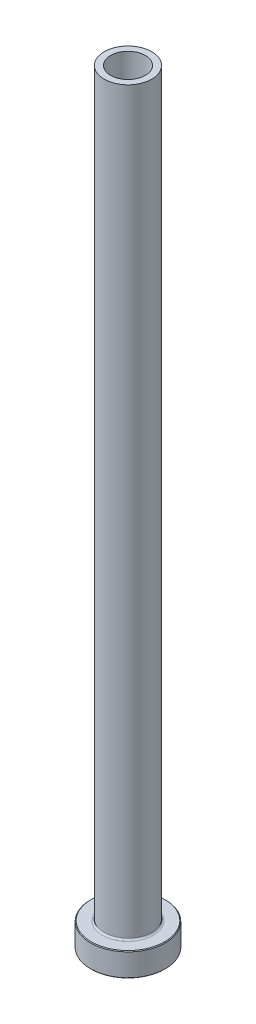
ISO-10303-21;
HEADER;
FILE_DESCRIPTION(('STEP AP214'),'2;1');
FILE_NAME('part.step','',(''),(''),'','','');
FILE_SCHEMA(('AUTOMOTIVE_DESIGN { 1 0 10303 214 1 1 1 1 }'));
ENDSEC;
DATA;
#1=APPLICATION_CONTEXT('core data for automotive mechanical design processes');
#2=APPLICATION_PROTOCOL_DEFINITION('international standard','automotive_design',2000,#1);
#3=PRODUCT_CONTEXT('',#1,'mechanical');
#4=PRODUCT('Part','Part','',(#3));
#5=PRODUCT_RELATED_PRODUCT_CATEGORY('part','',(#4));
#6=PRODUCT_DEFINITION_FORMATION('','',#4);
#7=PRODUCT_DEFINITION_CONTEXT('part definition',#1,'design');
#8=PRODUCT_DEFINITION('design','',#6,#7);
#9=PRODUCT_DEFINITION_SHAPE('','',#8);
#10=(LENGTH_UNIT() NAMED_UNIT(*) SI_UNIT(.MILLI.,.METRE.));
#11=(NAMED_UNIT(*) PLANE_ANGLE_UNIT() SI_UNIT($,.RADIAN.));
#12=(NAMED_UNIT(*) SI_UNIT($,.STERADIAN.) SOLID_ANGLE_UNIT());
#13=UNCERTAINTY_MEASURE_WITH_UNIT(LENGTH_MEASURE(1.E-05),#10,'distance_accuracy_value','');
#14=(GEOMETRIC_REPRESENTATION_CONTEXT(3) GLOBAL_UNCERTAINTY_ASSIGNED_CONTEXT((#13)) GLOBAL_UNIT_ASSIGNED_CONTEXT((#10,
#11,#12)) REPRESENTATION_CONTEXT('',''));
#15=CARTESIAN_POINT('',(0.,0.,0.));
#16=DIRECTION('',(0.,0.,1.));
#17=DIRECTION('',(1.,0.,0.));
#18=AXIS2_PLACEMENT_3D('',#15,#16,#17);
#19=CARTESIAN_POINT('',(0.,92.1876809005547,0.));
#20=DIRECTION('',(0.,1.,0.));
#21=DIRECTION('',(0.,0.,1.));
#22=AXIS2_PLACEMENT_3D('',#19,#20,#21);
#23=CYLINDRICAL_SURFACE('',#22,5.10000000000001);
#24=CARTESIAN_POINT('',(0.,225.,0.));
#25=DIRECTION('',(0.,1.,0.));
#26=DIRECTION('',(0.,0.,1.));
#27=AXIS2_PLACEMENT_3D('',#24,#25,#26);
#28=CIRCLE('',#27,5.10000000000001);
#29=CARTESIAN_POINT('',(0.,225.,5.10000000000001));
#30=VERTEX_POINT('',#29);
#31=EDGE_CURVE('E62',#30,#30,#28,.T.);
#32=ORIENTED_EDGE('',*,*,#31,.T.);
#33=EDGE_LOOP('',(#32));
#34=FACE_BOUND('',#33,.T.);
#35=CARTESIAN_POINT('',(0.,170.,0.));
#36=DIRECTION('',(0.,1.,0.));
#37=DIRECTION('',(0.,0.,1.));
#38=AXIS2_PLACEMENT_3D('',#35,#36,#37);
#39=CIRCLE('',#38,5.10000000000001);
#40=CARTESIAN_POINT('',(0.,170.,5.10000000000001));
#41=VERTEX_POINT('',#40);
#42=EDGE_CURVE('E71',#41,#41,#39,.T.);
#43=ORIENTED_EDGE('',*,*,#42,.F.);
#44=EDGE_LOOP('',(#43));
#45=FACE_BOUND('',#44,.T.);
#46=ADVANCED_FACE('F30',(#34,#45),#23,.F.);
#47=CARTESIAN_POINT('',(-5.10000000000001,225.,0.));
#48=DIRECTION('',(0.,1.,0.));
#49=DIRECTION('',(0.,0.,1.));
#50=AXIS2_PLACEMENT_3D('',#47,#48,#49);
#51=PLANE('',#50);
#52=CARTESIAN_POINT('',(0.,225.,0.));
#53=DIRECTION('',(0.,1.,0.));
#54=DIRECTION('',(0.,0.,1.));
#55=AXIS2_PLACEMENT_3D('',#52,#53,#54);
#56=CIRCLE('',#55,7.00000000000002);
#57=CARTESIAN_POINT('',(0.,225.,7.00000000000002));
#58=VERTEX_POINT('',#57);
#59=EDGE_CURVE('E65',#58,#58,#56,.T.);
#60=ORIENTED_EDGE('',*,*,#59,.T.);
#61=EDGE_LOOP('',(#60));
#62=FACE_BOUND('',#61,.T.);
#63=ORIENTED_EDGE('',*,*,#31,.F.);
#64=EDGE_LOOP('',(#63));
#65=FACE_BOUND('',#64,.T.);
#66=ADVANCED_FACE('F79',(#62,#65),#51,.T.);
#67=CARTESIAN_POINT('',(0.,92.1876809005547,0.));
#68=DIRECTION('',(0.,1.,0.));
#69=DIRECTION('',(0.,0.,1.));
#70=AXIS2_PLACEMENT_3D('',#67,#68,#69);
#71=CYLINDRICAL_SURFACE('',#70,7.);
#72=CARTESIAN_POINT('',(0.,7.50000000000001,0.));
#73=DIRECTION('',(0.,1.,0.));
#74=DIRECTION('',(0.,0.,1.));
#75=AXIS2_PLACEMENT_3D('',#72,#73,#74);
#76=CIRCLE('',#75,7.);
#77=CARTESIAN_POINT('',(0.,7.50000000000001,7.));
#78=VERTEX_POINT('',#77);
#79=EDGE_CURVE('E59',#78,#78,#76,.T.);
#80=ORIENTED_EDGE('',*,*,#79,.T.);
#81=EDGE_LOOP('',(#80));
#82=FACE_BOUND('',#81,.T.);
#83=ORIENTED_EDGE('',*,*,#59,.F.);
#84=EDGE_LOOP('',(#83));
#85=FACE_BOUND('',#84,.T.);
#86=ADVANCED_FACE('F85',(#82,#85),#71,.T.);
#87=CARTESIAN_POINT('',(-6.99999999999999,7.,0.));
#88=DIRECTION('',(0.,1.,0.));
#89=DIRECTION('',(0.,0.,1.));
#90=AXIS2_PLACEMENT_3D('',#87,#88,#89);
#91=PLANE('',#90);
#92=CARTESIAN_POINT('',(0.,7.,0.));
#93=DIRECTION('',(0.,1.,0.));
#94=DIRECTION('',(0.,0.,1.));
#95=AXIS2_PLACEMENT_3D('',#92,#93,#94);
#96=CIRCLE('',#95,10.8);
#97=CARTESIAN_POINT('',(0.,7.,10.8));
#98=VERTEX_POINT('',#97);
#99=EDGE_CURVE('E53',#98,#98,#96,.T.);
#100=ORIENTED_EDGE('',*,*,#99,.T.);
#101=EDGE_LOOP('',(#100));
#102=FACE_BOUND('',#101,.T.);
#103=CARTESIAN_POINT('',(0.,7.,0.));
#104=DIRECTION('',(0.,1.,0.));
#105=DIRECTION('',(0.,0.,1.));
#106=AXIS2_PLACEMENT_3D('',#103,#104,#105);
#107=CIRCLE('',#106,7.5);
#108=CARTESIAN_POINT('',(0.,7.,7.5));
#109=VERTEX_POINT('',#108);
#110=EDGE_CURVE('E56',#109,#109,#107,.F.);
#111=ORIENTED_EDGE('',*,*,#110,.T.);
#112=EDGE_LOOP('',(#111));
#113=FACE_BOUND('',#112,.T.);
#114=ADVANCED_FACE('F111',(#102,#113),#91,.T.);
#115=CARTESIAN_POINT('',(0.,92.1876809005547,0.));
#116=DIRECTION('',(0.,1.,0.));
#117=DIRECTION('',(0.,0.,1.));
#118=AXIS2_PLACEMENT_3D('',#115,#116,#117);
#119=CYLINDRICAL_SURFACE('',#118,11.);
#120=CARTESIAN_POINT('',(0.,6.79999999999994,0.));
#121=DIRECTION('',(0.,1.,0.));
#122=DIRECTION('',(0.,0.,1.));
#123=AXIS2_PLACEMENT_3D('',#120,#121,#122);
#124=CIRCLE('',#123,11.);
#125=CARTESIAN_POINT('',(0.,6.79999999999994,11.));
#126=VERTEX_POINT('',#125);
#127=EDGE_CURVE('E45',#126,#126,#124,.F.);
#128=ORIENTED_EDGE('',*,*,#127,.T.);
#129=EDGE_LOOP('',(#128));
#130=FACE_BOUND('',#129,.T.);
#131=CARTESIAN_POINT('',(0.,0.19999999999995,0.));
#132=DIRECTION('',(0.,-1.,0.));
#133=DIRECTION('',(0.,0.,-1.));
#134=AXIS2_PLACEMENT_3D('',#131,#132,#133);
#135=CIRCLE('',#134,11.);
#136=CARTESIAN_POINT('',(0.,0.19999999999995,11.));
#137=VERTEX_POINT('',#136);
#138=EDGE_CURVE('E50',#137,#137,#135,.F.);
#139=ORIENTED_EDGE('',*,*,#138,.T.);
#140=EDGE_LOOP('',(#139));
#141=FACE_BOUND('',#140,.T.);
#142=ADVANCED_FACE('F108',(#130,#141),#119,.T.);
#143=CARTESIAN_POINT('',(-11.,0.,0.));
#144=DIRECTION('',(0.,-1.,0.));
#145=DIRECTION('',(0.,0.,-1.));
#146=AXIS2_PLACEMENT_3D('',#143,#144,#145);
#147=PLANE('',#146);
#148=CARTESIAN_POINT('',(0.,0.,0.));
#149=DIRECTION('',(0.,-1.,0.));
#150=DIRECTION('',(0.,0.,-1.));
#151=AXIS2_PLACEMENT_3D('',#148,#149,#150);
#152=CIRCLE('',#151,5.85000000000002);
#153=CARTESIAN_POINT('',(0.,0.,-5.85000000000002));
#154=VERTEX_POINT('',#153);
#155=EDGE_CURVE('E37',#154,#154,#152,.F.);
#156=ORIENTED_EDGE('',*,*,#155,.T.);
#157=EDGE_LOOP('',(#156));
#158=FACE_BOUND('',#157,.T.);
#159=CARTESIAN_POINT('',(0.,0.,0.));
#160=DIRECTION('',(0.,-1.,0.));
#161=DIRECTION('',(0.,0.,-1.));
#162=AXIS2_PLACEMENT_3D('',#159,#160,#161);
#163=CIRCLE('',#162,10.8);
#164=CARTESIAN_POINT('',(0.,0.,10.8));
#165=VERTEX_POINT('',#164);
#166=EDGE_CURVE('E41',#165,#165,#163,.T.);
#167=ORIENTED_EDGE('',*,*,#166,.T.);
#168=EDGE_LOOP('',(#167));
#169=FACE_BOUND('',#168,.T.);
#170=ADVANCED_FACE('F110',(#158,#169),#147,.T.);
#171=CARTESIAN_POINT('',(0.,92.1876809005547,0.));
#172=DIRECTION('',(0.,1.,0.));
#173=DIRECTION('',(0.,0.,1.));
#174=AXIS2_PLACEMENT_3D('',#171,#172,#173);
#175=CYLINDRICAL_SURFACE('',#174,5.35);
#176=CARTESIAN_POINT('',(0.,0.500000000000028,0.));
#177=DIRECTION('',(0.,-1.,0.));
#178=DIRECTION('',(0.,0.,-1.));
#179=AXIS2_PLACEMENT_3D('',#176,#177,#178);
#180=CIRCLE('',#179,5.35);
#181=CARTESIAN_POINT('',(0.,0.500000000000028,-5.35));
#182=VERTEX_POINT('',#181);
#183=EDGE_CURVE('E10',#182,#182,#180,.T.);
#184=ORIENTED_EDGE('',*,*,#183,.T.);
#185=EDGE_LOOP('',(#184));
#186=FACE_BOUND('',#185,.T.);
#187=CARTESIAN_POINT('',(0.,158.,0.));
#188=DIRECTION('',(0.,1.,0.));
#189=DIRECTION('',(0.,0.,1.));
#190=AXIS2_PLACEMENT_3D('',#187,#188,#189);
#191=CIRCLE('',#190,5.35000000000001);
#192=CARTESIAN_POINT('',(0.,158.,5.35000000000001));
#193=VERTEX_POINT('',#192);
#194=EDGE_CURVE('E68',#193,#193,#191,.T.);
#195=ORIENTED_EDGE('',*,*,#194,.T.);
#196=EDGE_LOOP('',(#195));
#197=FACE_BOUND('',#196,.T.);
#198=ADVANCED_FACE('F118',(#186,#197),#175,.F.);
#199=CARTESIAN_POINT('',(0.,158.,0.));
#200=DIRECTION('',(0.,-1.,0.));
#201=DIRECTION('',(0.,0.,-1.));
#202=AXIS2_PLACEMENT_3D('',#199,#200,#201);
#203=CONICAL_SURFACE('',#202,5.35000000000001,0.0208303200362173);
#204=ORIENTED_EDGE('',*,*,#42,.T.);
#205=EDGE_LOOP('',(#204));
#206=FACE_BOUND('',#205,.T.);
#207=ORIENTED_EDGE('',*,*,#194,.F.);
#208=EDGE_LOOP('',(#207));
#209=FACE_BOUND('',#208,.T.);
#210=ADVANCED_FACE('F75',(#206,#209),#203,.F.);
#211=CARTESIAN_POINT('',(0.,7.50000000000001,0.));
#212=DIRECTION('',(0.,1.,0.));
#213=DIRECTION('',(0.,0.,1.));
#214=AXIS2_PLACEMENT_3D('',#211,#212,#213);
#215=TOROIDAL_SURFACE('',#214,7.5,0.5);
#216=ORIENTED_EDGE('',*,*,#110,.F.);
#217=EDGE_LOOP('',(#216));
#218=FACE_BOUND('',#217,.T.);
#219=ORIENTED_EDGE('',*,*,#79,.F.);
#220=EDGE_LOOP('',(#219));
#221=FACE_BOUND('',#220,.T.);
#222=ADVANCED_FACE('F90',(#218,#221),#215,.F.);
#223=CARTESIAN_POINT('',(0.,7.00000000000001,0.));
#224=DIRECTION('',(0.,-1.,0.));
#225=DIRECTION('',(0.,0.,-1.));
#226=AXIS2_PLACEMENT_3D('',#223,#224,#225);
#227=CONICAL_SURFACE('',#226,10.7999999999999,0.785398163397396);
#228=ORIENTED_EDGE('',*,*,#127,.F.);
#229=EDGE_LOOP('',(#228));
#230=FACE_BOUND('',#229,.T.);
#231=ORIENTED_EDGE('',*,*,#99,.F.);
#232=EDGE_LOOP('',(#231));
#233=FACE_BOUND('',#232,.T.);
#234=ADVANCED_FACE('F93',(#230,#233),#227,.T.);
#235=CARTESIAN_POINT('',(0.,0.19999999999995,0.));
#236=DIRECTION('',(0.,1.,0.));
#237=DIRECTION('',(0.,0.,1.));
#238=AXIS2_PLACEMENT_3D('',#235,#236,#237);
#239=CONICAL_SURFACE('',#238,11.,0.785398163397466);
#240=CARTESIAN_POINT('',(0.,0.,10.8));
#241=CARTESIAN_POINT('',(0.,0.00208333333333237,10.8020833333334));
#242=CARTESIAN_POINT('',(0.,0.00416666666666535,10.8041666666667));
#243=CARTESIAN_POINT('',(0.,0.0083333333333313,10.8083333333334));
#244=CARTESIAN_POINT('',(0.,0.0104166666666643,10.8104166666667));
#245=CARTESIAN_POINT('',(0.,0.0145833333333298,10.8145833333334));
#246=CARTESIAN_POINT('',(0.,0.0166666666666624,10.8166666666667));
#247=CARTESIAN_POINT('',(0.,0.020833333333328,10.8208333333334));
#248=CARTESIAN_POINT('',(0.,0.0229166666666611,10.8229166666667));
#249=CARTESIAN_POINT('',(0.,0.0270833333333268,10.8270833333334));
#250=CARTESIAN_POINT('',(0.,0.0291666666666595,10.8291666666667));
#251=CARTESIAN_POINT('',(0.,0.033333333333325,10.8333333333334));
#252=CARTESIAN_POINT('',(0.,0.0354166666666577,10.8354166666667));
#253=CARTESIAN_POINT('',(0.,0.0395833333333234,10.8395833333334));
#254=CARTESIAN_POINT('',(0.,0.0416666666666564,10.8416666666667));
#255=CARTESIAN_POINT('',(0.,0.0458333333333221,10.8458333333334));
#256=CARTESIAN_POINT('',(0.,0.0479166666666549,10.8479166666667));
#257=CARTESIAN_POINT('',(0.,0.0520833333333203,10.8520833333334));
#258=CARTESIAN_POINT('',(0.,0.054166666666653,10.8541666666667));
#259=CARTESIAN_POINT('',(0.,0.0583333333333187,10.8583333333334));
#260=CARTESIAN_POINT('',(0.,0.0604166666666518,10.8604166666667));
#261=CARTESIAN_POINT('',(0.,0.0645833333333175,10.8645833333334));
#262=CARTESIAN_POINT('',(0.,0.0666666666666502,10.8666666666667));
#263=CARTESIAN_POINT('',(0.,0.0708333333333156,10.8708333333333));
#264=CARTESIAN_POINT('',(0.,0.0729166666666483,10.8729166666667));
#265=CARTESIAN_POINT('',(0.,0.0770833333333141,10.8770833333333));
#266=CARTESIAN_POINT('',(0.,0.0791666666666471,10.8791666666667));
#267=CARTESIAN_POINT('',(0.,0.0833333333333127,10.8833333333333));
#268=CARTESIAN_POINT('',(0.,0.0854166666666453,10.8854166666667));
#269=CARTESIAN_POINT('',(0.,0.0895833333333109,10.8895833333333));
#270=CARTESIAN_POINT('',(0.,0.0916666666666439,10.8916666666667));
#271=CARTESIAN_POINT('',(0.,0.0958333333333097,10.8958333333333));
#272=CARTESIAN_POINT('',(0.,0.0979166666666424,10.8979166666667));
#273=CARTESIAN_POINT('',(0.,0.102083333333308,10.9020833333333));
#274=CARTESIAN_POINT('',(0.,0.104166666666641,10.9041666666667));
#275=CARTESIAN_POINT('',(0.,0.108333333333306,10.9083333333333));
#276=CARTESIAN_POINT('',(0.,0.110416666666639,10.9104166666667));
#277=CARTESIAN_POINT('',(0.,0.114583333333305,10.9145833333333));
#278=CARTESIAN_POINT('',(0.,0.116666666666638,10.9166666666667));
#279=CARTESIAN_POINT('',(0.,0.120833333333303,10.9208333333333));
#280=CARTESIAN_POINT('',(0.,0.122916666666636,10.9229166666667));
#281=CARTESIAN_POINT('',(0.,0.127083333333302,10.9270833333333));
#282=CARTESIAN_POINT('',(0.,0.129166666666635,10.9291666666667));
#283=CARTESIAN_POINT('',(0.,0.1333333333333,10.9333333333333));
#284=CARTESIAN_POINT('',(0.,0.135416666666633,10.9354166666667));
#285=CARTESIAN_POINT('',(0.,0.139583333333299,10.9395833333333));
#286=CARTESIAN_POINT('',(0.,0.141666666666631,10.9416666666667));
#287=CARTESIAN_POINT('',(0.,0.145833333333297,10.9458333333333));
#288=CARTESIAN_POINT('',(0.,0.14791666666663,10.9479166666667));
#289=CARTESIAN_POINT('',(0.,0.152083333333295,10.9520833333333));
#290=CARTESIAN_POINT('',(0.,0.154166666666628,10.9541666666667));
#291=CARTESIAN_POINT('',(0.,0.158333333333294,10.9583333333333));
#292=CARTESIAN_POINT('',(0.,0.160416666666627,10.9604166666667));
#293=CARTESIAN_POINT('',(0.,0.164583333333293,10.9645833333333));
#294=CARTESIAN_POINT('',(0.,0.166666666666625,10.9666666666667));
#295=CARTESIAN_POINT('',(0.,0.170833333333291,10.9708333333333));
#296=CARTESIAN_POINT('',(0.,0.172916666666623,10.9729166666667));
#297=CARTESIAN_POINT('',(0.,0.177083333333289,10.9770833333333));
#298=CARTESIAN_POINT('',(0.,0.179166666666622,10.9791666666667));
#299=CARTESIAN_POINT('',(0.,0.183333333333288,10.9833333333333));
#300=CARTESIAN_POINT('',(0.,0.18541666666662,10.9854166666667));
#301=CARTESIAN_POINT('',(0.,0.189583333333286,10.9895833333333));
#302=CARTESIAN_POINT('',(0.,0.191666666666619,10.9916666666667));
#303=CARTESIAN_POINT('',(0.,0.195833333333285,10.9958333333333));
#304=CARTESIAN_POINT('',(0.,0.197916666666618,10.9979166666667));
#305=CARTESIAN_POINT('',(0.,0.19999999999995,11.));
#306=B_SPLINE_CURVE_WITH_KNOTS('',3,(#240,#241,#242,#243,#244,#245,#246,#247,#248,#249,#250,
#251,#252,#253,#254,#255,#256,#257,#258,#259,#260,#261,#262,#263,#264,#265,#266,#267,#268,#269,
#270,#271,#272,#273,#274,#275,#276,#277,#278,#279,#280,#281,#282,#283,#284,#285,#286,#287,#288,
#289,#290,#291,#292,#293,#294,#295,#296,#297,#298,#299,#300,#301,#302,#303,#304,#305),
.UNSPECIFIED.,.F.,.F.,(4,2,2,2,2,2,2,2,2,2,2,2,2,2,2,2,2,2,2,2,2,2,2,2,2,2,2,2,2,2,2,2,4),(0.,
0.00883883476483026,0.0176776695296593,0.0265165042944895,0.0353553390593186,0.0441941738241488,
0.0530330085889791,0.0618718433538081,0.0707106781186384,0.0795495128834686,0.0883883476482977,
0.0972271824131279,0.106066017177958,0.114904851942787,0.123743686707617,0.132582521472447,
0.141421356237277,0.150260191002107,0.159099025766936,0.167937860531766,0.176776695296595,
0.185615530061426,0.194454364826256,0.203293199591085,0.212132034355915,0.220970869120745,
0.229809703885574,0.238648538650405,0.247487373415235,0.256326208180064,0.265165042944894,
0.274003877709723,0.282842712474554),.UNSPECIFIED.);
#307=EDGE_CURVE('BSEAM96',#165,#137,#306,.T.);
#308=ORIENTED_EDGE('',*,*,#166,.F.);
#309=ORIENTED_EDGE('',*,*,#138,.F.);
#310=ORIENTED_EDGE('',*,*,#307,.T.);
#311=ORIENTED_EDGE('',*,*,#307,.F.);
#312=EDGE_LOOP('',(#308,#310,#309,#311));
#313=FACE_BOUND('',#312,.T.);
#314=ADVANCED_FACE('F96',(#313),#239,.T.);
#315=CARTESIAN_POINT('',(0.,0.,0.));
#316=DIRECTION('',(0.,-1.,0.));
#317=DIRECTION('',(0.,0.,-1.));
#318=AXIS2_PLACEMENT_3D('',#315,#316,#317);
#319=CONICAL_SURFACE('',#318,5.85000000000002,0.785398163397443);
#320=ORIENTED_EDGE('',*,*,#183,.F.);
#321=EDGE_LOOP('',(#320));
#322=FACE_BOUND('',#321,.T.);
#323=ORIENTED_EDGE('',*,*,#155,.F.);
#324=EDGE_LOOP('',(#323));
#325=FACE_BOUND('',#324,.T.);
#326=ADVANCED_FACE('F32',(#322,#325),#319,.F.);
#327=CLOSED_SHELL('',(#46,#66,#86,#114,#142,#170,#198,#210,#222,#234,#314,#326));
#328=MANIFOLD_SOLID_BREP('B2',#327);
#329=ADVANCED_BREP_SHAPE_REPRESENTATION('',(#18,#328),#14);
#330=SHAPE_DEFINITION_REPRESENTATION(#9,#329);
ENDSEC;
END-ISO-10303-21;
